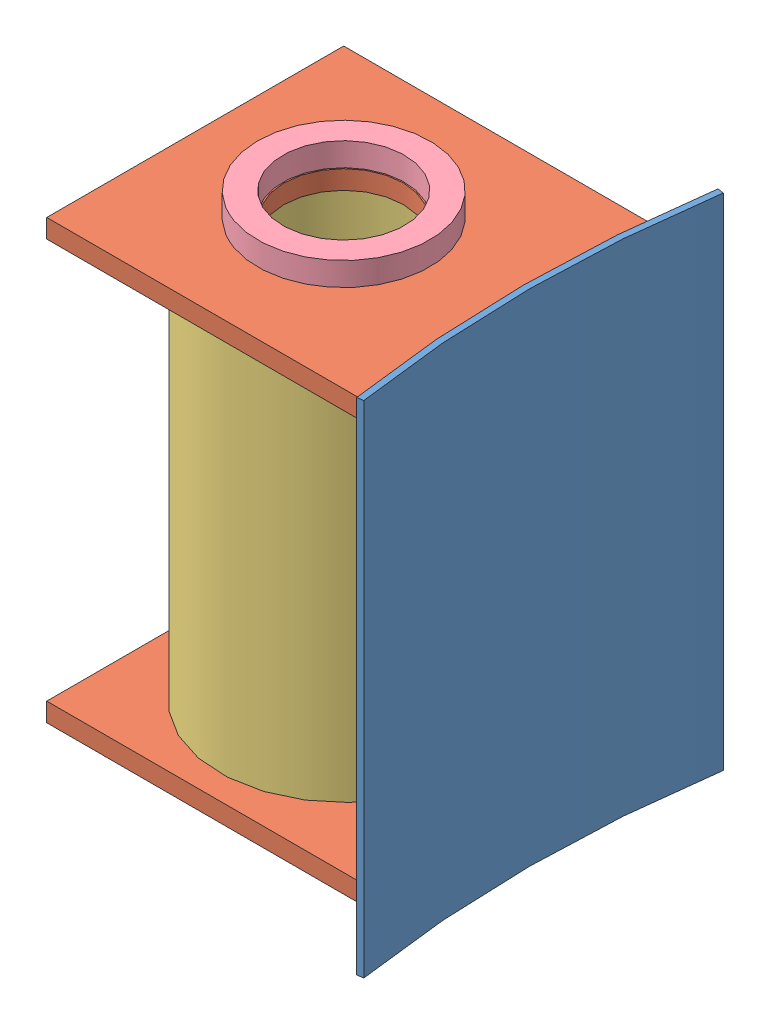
SolidWorks assembly Galgenaufnahme.SLDASM, configuration Standard (file format 4400). Lengths in mm.
Overall size (224.64 320 231.23).
5 component instances, 4 part files, 10 mates.
Components (placement in the parent):
- Futterblech_320x230-1: Futterblech_320x230.SLDPRT [Standard] at origin size (12.87 320 231.23)
- Fuehrung_216x190-1: Fuehrung_216x190.SLDPRT [Standard] at (-963.9913 288 95) size (216 12 190)
- Fuehrung_216x190-2: Fuehrung_216x190.SLDPRT [Standard] at (-963.9913 20 95) size (216 12 190)
- Rohr_159x5-1: Rohr_159x5.SLDPRT [Standard] at (-868.9913 32 0) x (0.248863 0 0.968539) z (-0.968539 0 0.248863) size (159 256 159)
- Ring_100_78-1: Ring_100_78.SLDPRT [Standard] at (-868.9913 300 0) x (0.902645 0 0.430386) z (-0.430386 0 0.902645) size (110 15 110)
Mates (geometry in assembly coordinates):
- Deckungsgleich3: coincident aligned: plane of Fuehrung_216x190-1 through (-963.9913 300 95) normal (0 0 1); plane of Fuehrung_216x190-2 through (-963.9913 32 95) normal (0 0 1)
- Deckungsgleich4: coincident aligned: plane of Fuehrung_216x190-1 through (-963.9913 300 95) normal (-1 0 0); plane of Fuehrung_216x190-2 through (-963.9913 32 95) normal (-1 0 0)
- Abstand3: distance = 256 mm anti-aligned: plane of Fuehrung_216x190-1 through (0 288 0) normal (0 -1 0); plane of Fuehrung_216x190-2 through (0 32 0) normal (0 1 0)
- Konzentrisch2: concentric aligned: cylinder of Fuehrung_216x190-1 through (-868.9913 300 0) axis (0 -1 0) radius 38.25; cylinder of Rohr_159x5-1 through (-868.9913 288 0) axis (0 -1 0) radius 79.5
- Deckungsgleich6: coincident anti-aligned: plane of Fuehrung_216x190-1 through (0 288 0) normal (0 -1 0); plane of Rohr_159x5-1 through (-868.9913 288 0) normal (0 1 0)
- Konzentrisch3: concentric aligned: cylinder of Fuehrung_216x190-1 through (-868.9913 300 0) axis (0 -1 0) radius 38.25; cylinder of Ring_100_78-1 through (-868.9913 315 0) axis (0 -1 0) radius 55
- Deckungsgleich7: coincident anti-aligned: plane of Fuehrung_216x190-1 through (0 300 0) normal (0 1 0); plane of Ring_100_78-1 through (-868.9913 300 0) normal (0 -1 0)
- Abstand4: distance = 20 mm aligned: plane of Fuehrung_216x190-1 through (0 300 0) normal (0 1 0); plane of Futterblech_320x230-1 through (0 320 0) normal (0 1 0)
- Parallel1: parallel aligned: plane of Fuehrung_216x190-1 through (-963.9913 300 95) normal (0 0 1); plane of assembly through (0 0 0) normal (0 0 1)
- Konzentrisch7: concentric aligned: cylinder of Futterblech_320x230-1 through (0 320 0) axis (0 -1 0) radius 754; cylinder of Fuehrung_216x190-1 through (0 300 0) axis (0 -1 0) radius 754
